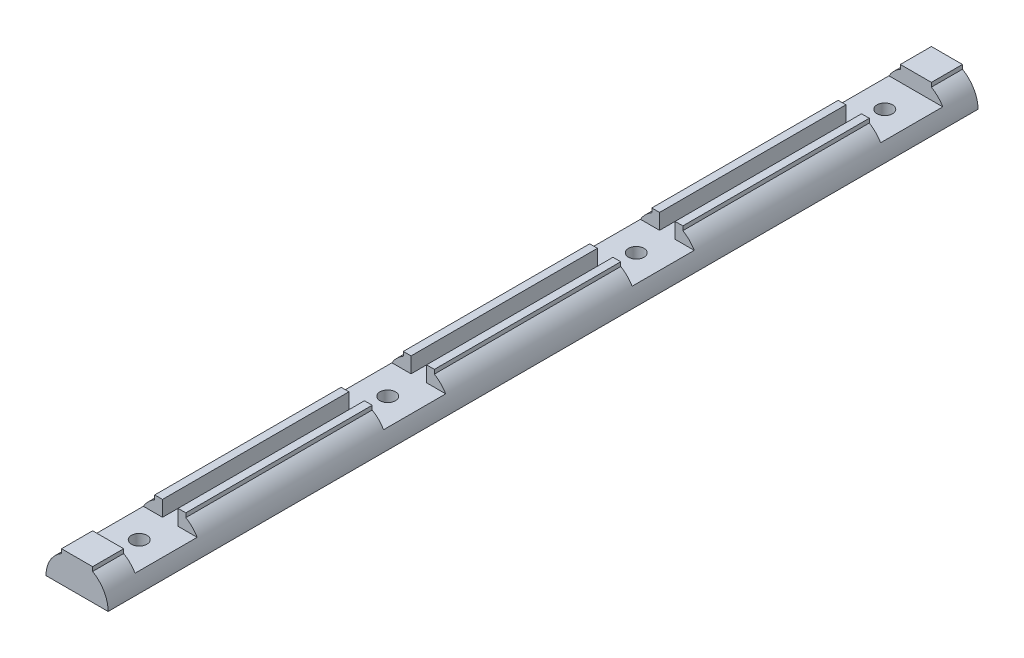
ISO-10303-21;
HEADER;
FILE_DESCRIPTION(('STEP AP214'),'2;1');
FILE_NAME('part.step','',(''),(''),'','','');
FILE_SCHEMA(('AUTOMOTIVE_DESIGN { 1 0 10303 214 1 1 1 1 }'));
ENDSEC;
DATA;
#1=APPLICATION_CONTEXT('core data for automotive mechanical design processes');
#2=APPLICATION_PROTOCOL_DEFINITION('international standard','automotive_design',2000,#1);
#3=PRODUCT_CONTEXT('',#1,'mechanical');
#4=PRODUCT('Part','Part','',(#3));
#5=PRODUCT_RELATED_PRODUCT_CATEGORY('part','',(#4));
#6=PRODUCT_DEFINITION_FORMATION('','',#4);
#7=PRODUCT_DEFINITION_CONTEXT('part definition',#1,'design');
#8=PRODUCT_DEFINITION('design','',#6,#7);
#9=PRODUCT_DEFINITION_SHAPE('','',#8);
#10=(LENGTH_UNIT() NAMED_UNIT(*) SI_UNIT(.MILLI.,.METRE.));
#11=(NAMED_UNIT(*) PLANE_ANGLE_UNIT() SI_UNIT($,.RADIAN.));
#12=(NAMED_UNIT(*) SI_UNIT($,.STERADIAN.) SOLID_ANGLE_UNIT());
#13=UNCERTAINTY_MEASURE_WITH_UNIT(LENGTH_MEASURE(1.E-05),#10,'distance_accuracy_value','');
#14=(GEOMETRIC_REPRESENTATION_CONTEXT(3) GLOBAL_UNCERTAINTY_ASSIGNED_CONTEXT((#13)) GLOBAL_UNIT_ASSIGNED_CONTEXT((#10,
#11,#12)) REPRESENTATION_CONTEXT('',''));
#15=CARTESIAN_POINT('',(0.,0.,0.));
#16=DIRECTION('',(0.,0.,1.));
#17=DIRECTION('',(1.,0.,0.));
#18=AXIS2_PLACEMENT_3D('',#15,#16,#17);
#19=CARTESIAN_POINT('',(0.,0.,140.));
#20=DIRECTION('',(0.,0.,-1.));
#21=DIRECTION('',(-1.,0.,0.));
#22=AXIS2_PLACEMENT_3D('',#19,#20,#21);
#23=CYLINDRICAL_SURFACE('',#22,10.);
#24=CARTESIAN_POINT('',(0.,0.,-140.));
#25=DIRECTION('',(0.,0.,1.));
#26=DIRECTION('',(1.,0.,0.));
#27=AXIS2_PLACEMENT_3D('',#24,#25,#26);
#28=CIRCLE('',#27,10.);
#29=CARTESIAN_POINT('',(-5.,8.66025403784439,-140.));
#30=VERTEX_POINT('',#29);
#31=CARTESIAN_POINT('',(-10.,0.,-140.));
#32=VERTEX_POINT('',#31);
#33=EDGE_CURVE('E324',#30,#32,#28,.T.);
#34=ORIENTED_EDGE('',*,*,#33,.T.);
#35=DIRECTION('',(0.,0.,1.));
#36=VECTOR('',#35,1.);
#37=CARTESIAN_POINT('',(-10.,0.,-140.));
#38=LINE('',#37,#36);
#39=CARTESIAN_POINT('',(-10.,0.,140.));
#40=VERTEX_POINT('',#39);
#41=EDGE_CURVE('E49',#32,#40,#38,.T.);
#42=ORIENTED_EDGE('',*,*,#41,.T.);
#43=CARTESIAN_POINT('',(0.,0.,140.));
#44=DIRECTION('',(0.,0.,1.));
#45=DIRECTION('',(1.,0.,0.));
#46=AXIS2_PLACEMENT_3D('',#43,#44,#45);
#47=CIRCLE('',#46,10.);
#48=CARTESIAN_POINT('',(-5.,8.66025403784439,140.));
#49=VERTEX_POINT('',#48);
#50=EDGE_CURVE('E336',#49,#40,#47,.T.);
#51=ORIENTED_EDGE('',*,*,#50,.F.);
#52=DIRECTION('',(0.,0.,-1.));
#53=VECTOR('',#52,1.);
#54=CARTESIAN_POINT('',(-5.,8.66025403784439,140.));
#55=LINE('',#54,#53);
#56=CARTESIAN_POINT('',(-5.,8.66025403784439,130.));
#57=VERTEX_POINT('',#56);
#58=EDGE_CURVE('E325',#49,#57,#55,.T.);
#59=ORIENTED_EDGE('',*,*,#58,.T.);
#60=CARTESIAN_POINT('',(0.,0.,130.));
#61=DIRECTION('',(0.,0.,1.));
#62=DIRECTION('',(1.,0.,0.));
#63=AXIS2_PLACEMENT_3D('',#60,#61,#62);
#64=CIRCLE('',#63,10.);
#65=CARTESIAN_POINT('',(-8.66025403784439,5.,130.));
#66=VERTEX_POINT('',#65);
#67=EDGE_CURVE('E590',#57,#66,#64,.T.);
#68=ORIENTED_EDGE('',*,*,#67,.T.);
#69=DIRECTION('',(0.,0.,1.));
#70=VECTOR('',#69,1.);
#71=CARTESIAN_POINT('',(-8.66025403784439,5.,110.));
#72=LINE('',#71,#70);
#73=CARTESIAN_POINT('',(-8.66025403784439,5.,110.));
#74=VERTEX_POINT('',#73);
#75=EDGE_CURVE('E626',#74,#66,#72,.T.);
#76=ORIENTED_EDGE('',*,*,#75,.F.);
#77=CARTESIAN_POINT('',(0.,0.,110.));
#78=DIRECTION('',(0.,0.,1.));
#79=DIRECTION('',(1.,0.,0.));
#80=AXIS2_PLACEMENT_3D('',#77,#78,#79);
#81=CIRCLE('',#80,10.);
#82=CARTESIAN_POINT('',(-5.,8.66025403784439,110.));
#83=VERTEX_POINT('',#82);
#84=EDGE_CURVE('E635',#83,#74,#81,.T.);
#85=ORIENTED_EDGE('',*,*,#84,.F.);
#86=CARTESIAN_POINT('',(-5.,8.66025403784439,50.));
#87=VERTEX_POINT('',#86);
#88=EDGE_CURVE('E328',#83,#87,#55,.T.);
#89=ORIENTED_EDGE('',*,*,#88,.T.);
#90=CARTESIAN_POINT('',(0.,0.,50.));
#91=DIRECTION('',(0.,0.,1.));
#92=DIRECTION('',(1.,0.,0.));
#93=AXIS2_PLACEMENT_3D('',#90,#91,#92);
#94=CIRCLE('',#93,10.);
#95=CARTESIAN_POINT('',(-8.66025403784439,5.,50.));
#96=VERTEX_POINT('',#95);
#97=EDGE_CURVE('E501',#87,#96,#94,.T.);
#98=ORIENTED_EDGE('',*,*,#97,.T.);
#99=DIRECTION('',(0.,0.,1.));
#100=VECTOR('',#99,1.);
#101=CARTESIAN_POINT('',(-8.66025403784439,5.,30.));
#102=LINE('',#101,#100);
#103=CARTESIAN_POINT('',(-8.66025403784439,5.,30.));
#104=VERTEX_POINT('',#103);
#105=EDGE_CURVE('E652',#104,#96,#102,.T.);
#106=ORIENTED_EDGE('',*,*,#105,.F.);
#107=CARTESIAN_POINT('',(0.,0.,30.));
#108=DIRECTION('',(0.,0.,1.));
#109=DIRECTION('',(1.,0.,0.));
#110=AXIS2_PLACEMENT_3D('',#107,#108,#109);
#111=CIRCLE('',#110,10.);
#112=CARTESIAN_POINT('',(-5.,8.66025403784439,30.));
#113=VERTEX_POINT('',#112);
#114=EDGE_CURVE('E506',#113,#104,#111,.T.);
#115=ORIENTED_EDGE('',*,*,#114,.F.);
#116=CARTESIAN_POINT('',(-5.,8.66025403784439,-30.));
#117=VERTEX_POINT('',#116);
#118=EDGE_CURVE('E559',#113,#117,#55,.T.);
#119=ORIENTED_EDGE('',*,*,#118,.T.);
#120=CARTESIAN_POINT('',(0.,0.,-30.));
#121=DIRECTION('',(0.,0.,1.));
#122=DIRECTION('',(1.,0.,0.));
#123=AXIS2_PLACEMENT_3D('',#120,#121,#122);
#124=CIRCLE('',#123,10.);
#125=CARTESIAN_POINT('',(-8.66025403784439,5.,-30.));
#126=VERTEX_POINT('',#125);
#127=EDGE_CURVE('E532',#117,#126,#124,.T.);
#128=ORIENTED_EDGE('',*,*,#127,.T.);
#129=DIRECTION('',(0.,0.,1.));
#130=VECTOR('',#129,1.);
#131=CARTESIAN_POINT('',(-8.66025403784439,5.,-50.));
#132=LINE('',#131,#130);
#133=CARTESIAN_POINT('',(-8.66025403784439,5.,-50.));
#134=VERTEX_POINT('',#133);
#135=EDGE_CURVE('E524',#134,#126,#132,.T.);
#136=ORIENTED_EDGE('',*,*,#135,.F.);
#137=CARTESIAN_POINT('',(0.,0.,-50.));
#138=DIRECTION('',(0.,0.,1.));
#139=DIRECTION('',(1.,0.,0.));
#140=AXIS2_PLACEMENT_3D('',#137,#138,#139);
#141=CIRCLE('',#140,10.);
#142=CARTESIAN_POINT('',(-5.,8.66025403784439,-50.));
#143=VERTEX_POINT('',#142);
#144=EDGE_CURVE('E376',#143,#134,#141,.T.);
#145=ORIENTED_EDGE('',*,*,#144,.F.);
#146=CARTESIAN_POINT('',(-5.,8.66025403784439,-110.));
#147=VERTEX_POINT('',#146);
#148=EDGE_CURVE('E467',#143,#147,#55,.T.);
#149=ORIENTED_EDGE('',*,*,#148,.T.);
#150=CARTESIAN_POINT('',(0.,0.,-110.));
#151=DIRECTION('',(0.,0.,1.));
#152=DIRECTION('',(1.,0.,0.));
#153=AXIS2_PLACEMENT_3D('',#150,#151,#152);
#154=CIRCLE('',#153,10.);
#155=CARTESIAN_POINT('',(-8.66025403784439,5.,-110.));
#156=VERTEX_POINT('',#155);
#157=EDGE_CURVE('E428',#147,#156,#154,.T.);
#158=ORIENTED_EDGE('',*,*,#157,.T.);
#159=DIRECTION('',(0.,0.,1.));
#160=VECTOR('',#159,1.);
#161=CARTESIAN_POINT('',(-8.66025403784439,5.,-130.));
#162=LINE('',#161,#160);
#163=CARTESIAN_POINT('',(-8.66025403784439,5.,-130.));
#164=VERTEX_POINT('',#163);
#165=EDGE_CURVE('E411',#164,#156,#162,.T.);
#166=ORIENTED_EDGE('',*,*,#165,.F.);
#167=CARTESIAN_POINT('',(0.,0.,-130.));
#168=DIRECTION('',(0.,0.,1.));
#169=DIRECTION('',(1.,0.,0.));
#170=AXIS2_PLACEMENT_3D('',#167,#168,#169);
#171=CIRCLE('',#170,10.);
#172=CARTESIAN_POINT('',(-5.,8.66025403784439,-130.));
#173=VERTEX_POINT('',#172);
#174=EDGE_CURVE('E436',#173,#164,#171,.T.);
#175=ORIENTED_EDGE('',*,*,#174,.F.);
#176=EDGE_CURVE('E330',#173,#30,#55,.T.);
#177=ORIENTED_EDGE('',*,*,#176,.T.);
#178=EDGE_LOOP('',(#34,#42,#51,#59,#68,#76,#85,#89,#98,#106,#115,#119,#128,#136,#145,#149,#158,
#166,#175,#177));
#179=FACE_BOUND('',#178,.T.);
#180=ADVANCED_FACE('F34',(#179),#23,.T.);
#181=CARTESIAN_POINT('',(10.,0.,140.));
#182=VERTEX_POINT('',#181);
#183=CARTESIAN_POINT('',(5.,8.66025403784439,140.));
#184=VERTEX_POINT('',#183);
#185=EDGE_CURVE('E318',#182,#184,#47,.T.);
#186=ORIENTED_EDGE('',*,*,#185,.F.);
#187=DIRECTION('',(0.,0.,1.));
#188=VECTOR('',#187,1.);
#189=CARTESIAN_POINT('',(10.,0.,-140.));
#190=LINE('',#189,#188);
#191=CARTESIAN_POINT('',(10.,0.,-140.));
#192=VERTEX_POINT('',#191);
#193=EDGE_CURVE('E303',#192,#182,#190,.T.);
#194=ORIENTED_EDGE('',*,*,#193,.F.);
#195=CARTESIAN_POINT('',(5.,8.66025403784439,-140.));
#196=VERTEX_POINT('',#195);
#197=EDGE_CURVE('E315',#192,#196,#28,.T.);
#198=ORIENTED_EDGE('',*,*,#197,.T.);
#199=DIRECTION('',(0.,0.,-1.));
#200=VECTOR('',#199,1.);
#201=CARTESIAN_POINT('',(5.,8.66025403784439,140.));
#202=LINE('',#201,#200);
#203=CARTESIAN_POINT('',(5.,8.66025403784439,-130.));
#204=VERTEX_POINT('',#203);
#205=EDGE_CURVE('E464',#196,#204,#202,.F.);
#206=ORIENTED_EDGE('',*,*,#205,.T.);
#207=CARTESIAN_POINT('',(0.,0.,-130.));
#208=DIRECTION('',(0.,0.,1.));
#209=DIRECTION('',(1.,0.,0.));
#210=AXIS2_PLACEMENT_3D('',#207,#208,#209);
#211=CIRCLE('',#210,10.);
#212=CARTESIAN_POINT('',(8.66025403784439,5.,-130.));
#213=VERTEX_POINT('',#212);
#214=EDGE_CURVE('E431',#213,#204,#211,.T.);
#215=ORIENTED_EDGE('',*,*,#214,.F.);
#216=DIRECTION('',(0.,0.,1.));
#217=VECTOR('',#216,1.);
#218=CARTESIAN_POINT('',(8.66025403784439,5.,-130.));
#219=LINE('',#218,#217);
#220=CARTESIAN_POINT('',(8.66025403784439,5.,-110.));
#221=VERTEX_POINT('',#220);
#222=EDGE_CURVE('E418',#213,#221,#219,.T.);
#223=ORIENTED_EDGE('',*,*,#222,.T.);
#224=CARTESIAN_POINT('',(0.,0.,-110.));
#225=DIRECTION('',(0.,0.,1.));
#226=DIRECTION('',(1.,0.,0.));
#227=AXIS2_PLACEMENT_3D('',#224,#225,#226);
#228=CIRCLE('',#227,10.);
#229=CARTESIAN_POINT('',(5.,8.66025403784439,-110.));
#230=VERTEX_POINT('',#229);
#231=EDGE_CURVE('E421',#221,#230,#228,.T.);
#232=ORIENTED_EDGE('',*,*,#231,.T.);
#233=CARTESIAN_POINT('',(5.,8.66025403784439,-50.));
#234=VERTEX_POINT('',#233);
#235=EDGE_CURVE('E465',#230,#234,#202,.F.);
#236=ORIENTED_EDGE('',*,*,#235,.T.);
#237=CARTESIAN_POINT('',(0.,0.,-50.));
#238=DIRECTION('',(0.,0.,1.));
#239=DIRECTION('',(1.,0.,0.));
#240=AXIS2_PLACEMENT_3D('',#237,#238,#239);
#241=CIRCLE('',#240,10.);
#242=CARTESIAN_POINT('',(8.66025403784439,5.,-50.));
#243=VERTEX_POINT('',#242);
#244=EDGE_CURVE('E540',#243,#234,#241,.T.);
#245=ORIENTED_EDGE('',*,*,#244,.F.);
#246=DIRECTION('',(0.,0.,1.));
#247=VECTOR('',#246,1.);
#248=CARTESIAN_POINT('',(8.66025403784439,5.,-50.));
#249=LINE('',#248,#247);
#250=CARTESIAN_POINT('',(8.66025403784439,5.,-30.));
#251=VERTEX_POINT('',#250);
#252=EDGE_CURVE('E521',#243,#251,#249,.T.);
#253=ORIENTED_EDGE('',*,*,#252,.T.);
#254=CARTESIAN_POINT('',(0.,0.,-30.));
#255=DIRECTION('',(0.,0.,1.));
#256=DIRECTION('',(1.,0.,0.));
#257=AXIS2_PLACEMENT_3D('',#254,#255,#256);
#258=CIRCLE('',#257,10.);
#259=CARTESIAN_POINT('',(5.,8.66025403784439,-30.));
#260=VERTEX_POINT('',#259);
#261=EDGE_CURVE('E485',#251,#260,#258,.T.);
#262=ORIENTED_EDGE('',*,*,#261,.T.);
#263=CARTESIAN_POINT('',(5.,8.66025403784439,30.));
#264=VERTEX_POINT('',#263);
#265=EDGE_CURVE('E469',#260,#264,#202,.F.);
#266=ORIENTED_EDGE('',*,*,#265,.T.);
#267=CARTESIAN_POINT('',(0.,0.,30.));
#268=DIRECTION('',(0.,0.,1.));
#269=DIRECTION('',(1.,0.,0.));
#270=AXIS2_PLACEMENT_3D('',#267,#268,#269);
#271=CIRCLE('',#270,10.);
#272=CARTESIAN_POINT('',(8.66025403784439,5.,30.));
#273=VERTEX_POINT('',#272);
#274=EDGE_CURVE('E483',#273,#264,#271,.T.);
#275=ORIENTED_EDGE('',*,*,#274,.F.);
#276=DIRECTION('',(0.,0.,1.));
#277=VECTOR('',#276,1.);
#278=CARTESIAN_POINT('',(8.66025403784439,5.,30.));
#279=LINE('',#278,#277);
#280=CARTESIAN_POINT('',(8.66025403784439,5.,50.));
#281=VERTEX_POINT('',#280);
#282=EDGE_CURVE('E649',#273,#281,#279,.T.);
#283=ORIENTED_EDGE('',*,*,#282,.T.);
#284=CARTESIAN_POINT('',(0.,0.,50.));
#285=DIRECTION('',(0.,0.,1.));
#286=DIRECTION('',(1.,0.,0.));
#287=AXIS2_PLACEMENT_3D('',#284,#285,#286);
#288=CIRCLE('',#287,10.);
#289=CARTESIAN_POINT('',(5.,8.66025403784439,50.));
#290=VERTEX_POINT('',#289);
#291=EDGE_CURVE('E657',#281,#290,#288,.T.);
#292=ORIENTED_EDGE('',*,*,#291,.T.);
#293=CARTESIAN_POINT('',(5.,8.66025403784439,110.));
#294=VERTEX_POINT('',#293);
#295=EDGE_CURVE('E470',#290,#294,#202,.F.);
#296=ORIENTED_EDGE('',*,*,#295,.T.);
#297=CARTESIAN_POINT('',(0.,0.,110.));
#298=DIRECTION('',(0.,0.,1.));
#299=DIRECTION('',(1.,0.,0.));
#300=AXIS2_PLACEMENT_3D('',#297,#298,#299);
#301=CIRCLE('',#300,10.);
#302=CARTESIAN_POINT('',(8.66025403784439,5.,110.));
#303=VERTEX_POINT('',#302);
#304=EDGE_CURVE('E630',#303,#294,#301,.T.);
#305=ORIENTED_EDGE('',*,*,#304,.F.);
#306=DIRECTION('',(0.,0.,1.));
#307=VECTOR('',#306,1.);
#308=CARTESIAN_POINT('',(8.66025403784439,5.,110.));
#309=LINE('',#308,#307);
#310=CARTESIAN_POINT('',(8.66025403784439,5.,130.));
#311=VERTEX_POINT('',#310);
#312=EDGE_CURVE('E622',#303,#311,#309,.T.);
#313=ORIENTED_EDGE('',*,*,#312,.T.);
#314=CARTESIAN_POINT('',(0.,0.,130.));
#315=DIRECTION('',(0.,0.,1.));
#316=DIRECTION('',(1.,0.,0.));
#317=AXIS2_PLACEMENT_3D('',#314,#315,#316);
#318=CIRCLE('',#317,10.);
#319=CARTESIAN_POINT('',(5.,8.66025403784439,130.));
#320=VERTEX_POINT('',#319);
#321=EDGE_CURVE('E637',#311,#320,#318,.T.);
#322=ORIENTED_EDGE('',*,*,#321,.T.);
#323=EDGE_CURVE('E446',#320,#184,#202,.F.);
#324=ORIENTED_EDGE('',*,*,#323,.T.);
#325=EDGE_LOOP('',(#186,#194,#198,#206,#215,#223,#232,#236,#245,#253,#262,#266,#275,#283,#292,
#296,#305,#313,#322,#324));
#326=FACE_BOUND('',#325,.T.);
#327=ADVANCED_FACE('F313',(#326),#23,.T.);
#328=CARTESIAN_POINT('',(-5.,-10.,-162.360679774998));
#329=DIRECTION('',(-1.,0.,0.));
#330=DIRECTION('',(0.,0.,1.));
#331=AXIS2_PLACEMENT_3D('',#328,#329,#330);
#332=PLANE('',#331);
#333=ORIENTED_EDGE('',*,*,#88,.F.);
#334=DIRECTION('',(0.,1.,0.));
#335=VECTOR('',#334,1.);
#336=CARTESIAN_POINT('',(-5.,-10.,110.));
#337=LINE('',#336,#335);
#338=CARTESIAN_POINT('',(-5.,10.,110.));
#339=VERTEX_POINT('',#338);
#340=EDGE_CURVE('E632',#83,#339,#337,.T.);
#341=ORIENTED_EDGE('',*,*,#340,.T.);
#342=DIRECTION('',(0.,0.,1.));
#343=VECTOR('',#342,1.);
#344=CARTESIAN_POINT('',(-5.,10.,-162.360679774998));
#345=LINE('',#344,#343);
#346=CARTESIAN_POINT('',(-5.,10.,50.));
#347=VERTEX_POINT('',#346);
#348=EDGE_CURVE('E565',#347,#339,#345,.T.);
#349=ORIENTED_EDGE('',*,*,#348,.F.);
#350=DIRECTION('',(0.,1.,0.));
#351=VECTOR('',#350,1.);
#352=CARTESIAN_POINT('',(-5.,-10.,50.));
#353=LINE('',#352,#351);
#354=EDGE_CURVE('E659',#87,#347,#353,.T.);
#355=ORIENTED_EDGE('',*,*,#354,.F.);
#356=EDGE_LOOP('',(#333,#341,#349,#355));
#357=FACE_BOUND('',#356,.T.);
#358=ADVANCED_FACE('F670',(#357),#332,.T.);
#359=CARTESIAN_POINT('',(5.,10.,-162.360679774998));
#360=DIRECTION('',(0.,1.,0.));
#361=DIRECTION('',(0.,0.,1.));
#362=AXIS2_PLACEMENT_3D('',#359,#360,#361);
#363=PLANE('',#362);
#364=ORIENTED_EDGE('',*,*,#348,.T.);
#365=DIRECTION('',(-1.,0.,0.));
#366=VECTOR('',#365,1.);
#367=CARTESIAN_POINT('',(8.66025403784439,10.,110.));
#368=LINE('',#367,#366);
#369=CARTESIAN_POINT('',(-2.5,10.,110.));
#370=VERTEX_POINT('',#369);
#371=EDGE_CURVE('E615',#370,#339,#368,.T.);
#372=ORIENTED_EDGE('',*,*,#371,.F.);
#373=DIRECTION('',(0.,0.,1.));
#374=VECTOR('',#373,1.);
#375=CARTESIAN_POINT('',(-2.5,10.,110.));
#376=LINE('',#375,#374);
#377=CARTESIAN_POINT('',(-2.5,10.,50.));
#378=VERTEX_POINT('',#377);
#379=EDGE_CURVE('E371',#378,#370,#376,.T.);
#380=ORIENTED_EDGE('',*,*,#379,.F.);
#381=DIRECTION('',(-1.,0.,0.));
#382=VECTOR('',#381,1.);
#383=CARTESIAN_POINT('',(8.66025403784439,10.,50.));
#384=LINE('',#383,#382);
#385=EDGE_CURVE('E646',#378,#347,#384,.T.);
#386=ORIENTED_EDGE('',*,*,#385,.T.);
#387=EDGE_LOOP('',(#364,#372,#380,#386));
#388=FACE_BOUND('',#387,.T.);
#389=ADVANCED_FACE('F754',(#388),#363,.T.);
#390=DIRECTION('',(0.,0.,-1.));
#391=VECTOR('',#390,1.);
#392=CARTESIAN_POINT('',(2.5,10.,110.));
#393=LINE('',#392,#391);
#394=CARTESIAN_POINT('',(2.5,10.,110.));
#395=VERTEX_POINT('',#394);
#396=CARTESIAN_POINT('',(2.5,10.,50.));
#397=VERTEX_POINT('',#396);
#398=EDGE_CURVE('E379',#395,#397,#393,.T.);
#399=ORIENTED_EDGE('',*,*,#398,.F.);
#400=CARTESIAN_POINT('',(5.,10.,110.));
#401=VERTEX_POINT('',#400);
#402=EDGE_CURVE('E618',#401,#395,#368,.T.);
#403=ORIENTED_EDGE('',*,*,#402,.F.);
#404=DIRECTION('',(0.,0.,1.));
#405=VECTOR('',#404,1.);
#406=CARTESIAN_POINT('',(5.,10.,-162.360679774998));
#407=LINE('',#406,#405);
#408=CARTESIAN_POINT('',(5.,10.,50.));
#409=VERTEX_POINT('',#408);
#410=EDGE_CURVE('E682',#409,#401,#407,.T.);
#411=ORIENTED_EDGE('',*,*,#410,.F.);
#412=EDGE_CURVE('E648',#409,#397,#384,.T.);
#413=ORIENTED_EDGE('',*,*,#412,.T.);
#414=EDGE_LOOP('',(#399,#403,#411,#413));
#415=FACE_BOUND('',#414,.T.);
#416=ADVANCED_FACE('F730',(#415),#363,.T.);
#417=CARTESIAN_POINT('',(5.,-10.,-162.360679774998));
#418=DIRECTION('',(1.,0.,0.));
#419=DIRECTION('',(0.,0.,-1.));
#420=AXIS2_PLACEMENT_3D('',#417,#418,#419);
#421=PLANE('',#420);
#422=ORIENTED_EDGE('',*,*,#410,.T.);
#423=DIRECTION('',(0.,-1.,0.));
#424=VECTOR('',#423,1.);
#425=CARTESIAN_POINT('',(5.,-10.,110.));
#426=LINE('',#425,#424);
#427=EDGE_CURVE('E625',#401,#294,#426,.T.);
#428=ORIENTED_EDGE('',*,*,#427,.T.);
#429=ORIENTED_EDGE('',*,*,#295,.F.);
#430=DIRECTION('',(0.,-1.,0.));
#431=VECTOR('',#430,1.);
#432=CARTESIAN_POINT('',(5.,-10.,50.));
#433=LINE('',#432,#431);
#434=EDGE_CURVE('E655',#409,#290,#433,.T.);
#435=ORIENTED_EDGE('',*,*,#434,.F.);
#436=EDGE_LOOP('',(#422,#428,#429,#435));
#437=FACE_BOUND('',#436,.T.);
#438=ADVANCED_FACE('F732',(#437),#421,.T.);
#439=ORIENTED_EDGE('',*,*,#118,.F.);
#440=DIRECTION('',(0.,1.,0.));
#441=VECTOR('',#440,1.);
#442=CARTESIAN_POINT('',(-5.,-10.,30.));
#443=LINE('',#442,#441);
#444=CARTESIAN_POINT('',(-5.,10.,30.));
#445=VERTEX_POINT('',#444);
#446=EDGE_CURVE('E499',#113,#445,#443,.T.);
#447=ORIENTED_EDGE('',*,*,#446,.T.);
#448=CARTESIAN_POINT('',(-5.,10.,-30.));
#449=VERTEX_POINT('',#448);
#450=EDGE_CURVE('E366',#449,#445,#345,.T.);
#451=ORIENTED_EDGE('',*,*,#450,.F.);
#452=DIRECTION('',(0.,1.,0.));
#453=VECTOR('',#452,1.);
#454=CARTESIAN_POINT('',(-5.,-10.,-30.));
#455=LINE('',#454,#453);
#456=EDGE_CURVE('E530',#117,#449,#455,.T.);
#457=ORIENTED_EDGE('',*,*,#456,.F.);
#458=EDGE_LOOP('',(#439,#447,#451,#457));
#459=FACE_BOUND('',#458,.T.);
#460=ADVANCED_FACE('F564',(#459),#332,.T.);
#461=ORIENTED_EDGE('',*,*,#450,.T.);
#462=DIRECTION('',(-1.,0.,0.));
#463=VECTOR('',#462,1.);
#464=CARTESIAN_POINT('',(8.66025403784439,10.,30.));
#465=LINE('',#464,#463);
#466=CARTESIAN_POINT('',(-2.5,10.,30.));
#467=VERTEX_POINT('',#466);
#468=EDGE_CURVE('E351',#467,#445,#465,.T.);
#469=ORIENTED_EDGE('',*,*,#468,.F.);
#470=CARTESIAN_POINT('',(-2.5,10.,-30.));
#471=VERTEX_POINT('',#470);
#472=EDGE_CURVE('E364',#471,#467,#376,.T.);
#473=ORIENTED_EDGE('',*,*,#472,.F.);
#474=DIRECTION('',(-1.,0.,0.));
#475=VECTOR('',#474,1.);
#476=CARTESIAN_POINT('',(8.66025403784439,10.,-30.));
#477=LINE('',#476,#475);
#478=EDGE_CURVE('E518',#471,#449,#477,.T.);
#479=ORIENTED_EDGE('',*,*,#478,.T.);
#480=EDGE_LOOP('',(#461,#469,#473,#479));
#481=FACE_BOUND('',#480,.T.);
#482=ADVANCED_FACE('F362',(#481),#363,.T.);
#483=CARTESIAN_POINT('',(2.5,10.,30.));
#484=VERTEX_POINT('',#483);
#485=CARTESIAN_POINT('',(2.5,10.,-30.));
#486=VERTEX_POINT('',#485);
#487=EDGE_CURVE('E720',#484,#486,#393,.T.);
#488=ORIENTED_EDGE('',*,*,#487,.F.);
#489=CARTESIAN_POINT('',(5.,10.,30.));
#490=VERTEX_POINT('',#489);
#491=EDGE_CURVE('E367',#490,#484,#465,.T.);
#492=ORIENTED_EDGE('',*,*,#491,.F.);
#493=CARTESIAN_POINT('',(5.,10.,-30.));
#494=VERTEX_POINT('',#493);
#495=EDGE_CURVE('E494',#494,#490,#407,.T.);
#496=ORIENTED_EDGE('',*,*,#495,.F.);
#497=EDGE_CURVE('E520',#494,#486,#477,.T.);
#498=ORIENTED_EDGE('',*,*,#497,.T.);
#499=EDGE_LOOP('',(#488,#492,#496,#498));
#500=FACE_BOUND('',#499,.T.);
#501=ADVANCED_FACE('F793',(#500),#363,.T.);
#502=ORIENTED_EDGE('',*,*,#495,.T.);
#503=DIRECTION('',(0.,-1.,0.));
#504=VECTOR('',#503,1.);
#505=CARTESIAN_POINT('',(5.,-10.,30.));
#506=LINE('',#505,#504);
#507=EDGE_CURVE('E493',#490,#264,#506,.T.);
#508=ORIENTED_EDGE('',*,*,#507,.T.);
#509=ORIENTED_EDGE('',*,*,#265,.F.);
#510=DIRECTION('',(0.,-1.,0.));
#511=VECTOR('',#510,1.);
#512=CARTESIAN_POINT('',(5.,-10.,-30.));
#513=LINE('',#512,#511);
#514=EDGE_CURVE('E491',#494,#260,#513,.T.);
#515=ORIENTED_EDGE('',*,*,#514,.F.);
#516=EDGE_LOOP('',(#502,#508,#509,#515));
#517=FACE_BOUND('',#516,.T.);
#518=ADVANCED_FACE('F490',(#517),#421,.T.);
#519=CARTESIAN_POINT('',(2.5,-215.056810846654,110.));
#520=DIRECTION('',(1.,0.,0.));
#521=DIRECTION('',(0.,0.,-1.));
#522=AXIS2_PLACEMENT_3D('',#519,#520,#521);
#523=PLANE('',#522);
#524=DIRECTION('',(0.,-1.,0.));
#525=VECTOR('',#524,1.);
#526=CARTESIAN_POINT('',(2.5,-215.056810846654,30.));
#527=LINE('',#526,#525);
#528=CARTESIAN_POINT('',(2.5,5.,30.));
#529=VERTEX_POINT('',#528);
#530=EDGE_CURVE('E497',#484,#529,#527,.T.);
#531=ORIENTED_EDGE('',*,*,#530,.F.);
#532=ORIENTED_EDGE('',*,*,#487,.T.);
#533=DIRECTION('',(0.,-1.,0.));
#534=VECTOR('',#533,1.);
#535=CARTESIAN_POINT('',(2.5,-215.056810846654,-30.));
#536=LINE('',#535,#534);
#537=CARTESIAN_POINT('',(2.5,5.,-30.));
#538=VERTEX_POINT('',#537);
#539=EDGE_CURVE('E523',#486,#538,#536,.T.);
#540=ORIENTED_EDGE('',*,*,#539,.T.);
#541=DIRECTION('',(0.,0.,-1.));
#542=VECTOR('',#541,1.);
#543=CARTESIAN_POINT('',(2.5,5.,110.));
#544=LINE('',#543,#542);
#545=EDGE_CURVE('E391',#529,#538,#544,.T.);
#546=ORIENTED_EDGE('',*,*,#545,.F.);
#547=EDGE_LOOP('',(#531,#532,#540,#546));
#548=FACE_BOUND('',#547,.T.);
#549=ADVANCED_FACE('F718',(#548),#523,.F.);
#550=CARTESIAN_POINT('',(-2.5,-215.056810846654,110.));
#551=DIRECTION('',(-1.,0.,0.));
#552=DIRECTION('',(0.,0.,1.));
#553=AXIS2_PLACEMENT_3D('',#550,#551,#552);
#554=PLANE('',#553);
#555=DIRECTION('',(0.,1.,0.));
#556=VECTOR('',#555,1.);
#557=CARTESIAN_POINT('',(-2.5,-215.056810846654,30.));
#558=LINE('',#557,#556);
#559=CARTESIAN_POINT('',(-2.5,5.,30.));
#560=VERTEX_POINT('',#559);
#561=EDGE_CURVE('E42',#560,#467,#558,.T.);
#562=ORIENTED_EDGE('',*,*,#561,.F.);
#563=DIRECTION('',(0.,0.,1.));
#564=VECTOR('',#563,1.);
#565=CARTESIAN_POINT('',(-2.5,5.,110.));
#566=LINE('',#565,#564);
#567=CARTESIAN_POINT('',(-2.5,5.,-30.));
#568=VERTEX_POINT('',#567);
#569=EDGE_CURVE('E385',#568,#560,#566,.T.);
#570=ORIENTED_EDGE('',*,*,#569,.F.);
#571=DIRECTION('',(0.,1.,0.));
#572=VECTOR('',#571,1.);
#573=CARTESIAN_POINT('',(-2.5,-215.056810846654,-30.));
#574=LINE('',#573,#572);
#575=EDGE_CURVE('E339',#568,#471,#574,.T.);
#576=ORIENTED_EDGE('',*,*,#575,.T.);
#577=ORIENTED_EDGE('',*,*,#472,.T.);
#578=EDGE_LOOP('',(#562,#570,#576,#577));
#579=FACE_BOUND('',#578,.T.);
#580=ADVANCED_FACE('F369',(#579),#554,.F.);
#581=ORIENTED_EDGE('',*,*,#148,.F.);
#582=DIRECTION('',(0.,1.,0.));
#583=VECTOR('',#582,1.);
#584=CARTESIAN_POINT('',(-5.,-10.,-50.));
#585=LINE('',#584,#583);
#586=CARTESIAN_POINT('',(-5.,10.,-50.));
#587=VERTEX_POINT('',#586);
#588=EDGE_CURVE('E542',#143,#587,#585,.T.);
#589=ORIENTED_EDGE('',*,*,#588,.T.);
#590=CARTESIAN_POINT('',(-5.,10.,-110.));
#591=VERTEX_POINT('',#590);
#592=EDGE_CURVE('E458',#591,#587,#345,.T.);
#593=ORIENTED_EDGE('',*,*,#592,.F.);
#594=DIRECTION('',(0.,1.,0.));
#595=VECTOR('',#594,1.);
#596=CARTESIAN_POINT('',(-5.,-10.,-110.));
#597=LINE('',#596,#595);
#598=EDGE_CURVE('E425',#147,#591,#597,.T.);
#599=ORIENTED_EDGE('',*,*,#598,.F.);
#600=EDGE_LOOP('',(#581,#589,#593,#599));
#601=FACE_BOUND('',#600,.T.);
#602=ADVANCED_FACE('F763',(#601),#332,.T.);
#603=ORIENTED_EDGE('',*,*,#592,.T.);
#604=DIRECTION('',(-1.,0.,0.));
#605=VECTOR('',#604,1.);
#606=CARTESIAN_POINT('',(8.66025403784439,10.,-50.));
#607=LINE('',#606,#605);
#608=CARTESIAN_POINT('',(-2.5,10.,-50.));
#609=VERTEX_POINT('',#608);
#610=EDGE_CURVE('E511',#609,#587,#607,.T.);
#611=ORIENTED_EDGE('',*,*,#610,.F.);
#612=CARTESIAN_POINT('',(-2.5,10.,-110.));
#613=VERTEX_POINT('',#612);
#614=EDGE_CURVE('E370',#613,#609,#376,.T.);
#615=ORIENTED_EDGE('',*,*,#614,.F.);
#616=DIRECTION('',(-1.,0.,0.));
#617=VECTOR('',#616,1.);
#618=CARTESIAN_POINT('',(8.66025403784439,10.,-110.));
#619=LINE('',#618,#617);
#620=EDGE_CURVE('E415',#613,#591,#619,.T.);
#621=ORIENTED_EDGE('',*,*,#620,.T.);
#622=EDGE_LOOP('',(#603,#611,#615,#621));
#623=FACE_BOUND('',#622,.T.);
#624=ADVANCED_FACE('F786',(#623),#363,.T.);
#625=CARTESIAN_POINT('',(2.5,10.,-50.));
#626=VERTEX_POINT('',#625);
#627=CARTESIAN_POINT('',(2.5,10.,-110.));
#628=VERTEX_POINT('',#627);
#629=EDGE_CURVE('E374',#626,#628,#393,.T.);
#630=ORIENTED_EDGE('',*,*,#629,.F.);
#631=CARTESIAN_POINT('',(5.,10.,-50.));
#632=VERTEX_POINT('',#631);
#633=EDGE_CURVE('E514',#632,#626,#607,.T.);
#634=ORIENTED_EDGE('',*,*,#633,.F.);
#635=CARTESIAN_POINT('',(5.,10.,-110.));
#636=VERTEX_POINT('',#635);
#637=EDGE_CURVE('E463',#636,#632,#407,.T.);
#638=ORIENTED_EDGE('',*,*,#637,.F.);
#639=EDGE_CURVE('E409',#636,#628,#619,.T.);
#640=ORIENTED_EDGE('',*,*,#639,.T.);
#641=EDGE_LOOP('',(#630,#634,#638,#640));
#642=FACE_BOUND('',#641,.T.);
#643=ADVANCED_FACE('F696',(#642),#363,.T.);
#644=ORIENTED_EDGE('',*,*,#637,.T.);
#645=DIRECTION('',(0.,-1.,0.));
#646=VECTOR('',#645,1.);
#647=CARTESIAN_POINT('',(5.,-10.,-50.));
#648=LINE('',#647,#646);
#649=EDGE_CURVE('E537',#632,#234,#648,.T.);
#650=ORIENTED_EDGE('',*,*,#649,.T.);
#651=ORIENTED_EDGE('',*,*,#235,.F.);
#652=DIRECTION('',(0.,-1.,0.));
#653=VECTOR('',#652,1.);
#654=CARTESIAN_POINT('',(5.,-10.,-110.));
#655=LINE('',#654,#653);
#656=EDGE_CURVE('E333',#636,#230,#655,.T.);
#657=ORIENTED_EDGE('',*,*,#656,.F.);
#658=EDGE_LOOP('',(#644,#650,#651,#657));
#659=FACE_BOUND('',#658,.T.);
#660=ADVANCED_FACE('F691',(#659),#421,.T.);
#661=DIRECTION('',(0.,-1.,0.));
#662=VECTOR('',#661,1.);
#663=CARTESIAN_POINT('',(2.5,-215.056810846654,-50.));
#664=LINE('',#663,#662);
#665=CARTESIAN_POINT('',(2.5,5.,-50.));
#666=VERTEX_POINT('',#665);
#667=EDGE_CURVE('E535',#626,#666,#664,.T.);
#668=ORIENTED_EDGE('',*,*,#667,.F.);
#669=ORIENTED_EDGE('',*,*,#629,.T.);
#670=DIRECTION('',(0.,1.,0.));
#671=VECTOR('',#670,1.);
#672=CARTESIAN_POINT('',(2.5,-215.056810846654,-110.));
#673=LINE('',#672,#671);
#674=CARTESIAN_POINT('',(2.5,5.,-110.));
#675=VERTEX_POINT('',#674);
#676=EDGE_CURVE('E390',#675,#628,#673,.T.);
#677=ORIENTED_EDGE('',*,*,#676,.F.);
#678=EDGE_CURVE('E392',#666,#675,#544,.T.);
#679=ORIENTED_EDGE('',*,*,#678,.F.);
#680=EDGE_LOOP('',(#668,#669,#677,#679));
#681=FACE_BOUND('',#680,.T.);
#682=ADVANCED_FACE('F703',(#681),#523,.F.);
#683=DIRECTION('',(0.,1.,0.));
#684=VECTOR('',#683,1.);
#685=CARTESIAN_POINT('',(-2.5,-215.056810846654,-50.));
#686=LINE('',#685,#684);
#687=CARTESIAN_POINT('',(-2.5,5.,-50.));
#688=VERTEX_POINT('',#687);
#689=EDGE_CURVE('E342',#688,#609,#686,.T.);
#690=ORIENTED_EDGE('',*,*,#689,.F.);
#691=CARTESIAN_POINT('',(-2.5,5.,-110.));
#692=VERTEX_POINT('',#691);
#693=EDGE_CURVE('E381',#692,#688,#566,.T.);
#694=ORIENTED_EDGE('',*,*,#693,.F.);
#695=DIRECTION('',(0.,1.,0.));
#696=VECTOR('',#695,1.);
#697=CARTESIAN_POINT('',(-2.5,-215.056810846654,-110.));
#698=LINE('',#697,#696);
#699=EDGE_CURVE('E393',#692,#613,#698,.T.);
#700=ORIENTED_EDGE('',*,*,#699,.T.);
#701=ORIENTED_EDGE('',*,*,#614,.T.);
#702=EDGE_LOOP('',(#690,#694,#700,#701));
#703=FACE_BOUND('',#702,.T.);
#704=ADVANCED_FACE('F780',(#703),#554,.F.);
#705=CARTESIAN_POINT('',(0.,0.,-110.));
#706=DIRECTION('',(0.,0.,1.));
#707=DIRECTION('',(1.,0.,0.));
#708=AXIS2_PLACEMENT_3D('',#705,#706,#707);
#709=PLANE('',#708);
#710=DIRECTION('',(1.,0.,0.));
#711=VECTOR('',#710,1.);
#712=CARTESIAN_POINT('',(8.66025403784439,5.,-110.));
#713=LINE('',#712,#711);
#714=EDGE_CURVE('E404',#675,#221,#713,.T.);
#715=ORIENTED_EDGE('',*,*,#714,.F.);
#716=ORIENTED_EDGE('',*,*,#676,.T.);
#717=ORIENTED_EDGE('',*,*,#639,.F.);
#718=ORIENTED_EDGE('',*,*,#656,.T.);
#719=ORIENTED_EDGE('',*,*,#231,.F.);
#720=EDGE_LOOP('',(#715,#716,#717,#718,#719));
#721=FACE_BOUND('',#720,.T.);
#722=ADVANCED_FACE('F772',(#721),#709,.F.);
#723=ORIENTED_EDGE('',*,*,#176,.F.);
#724=DIRECTION('',(0.,1.,0.));
#725=VECTOR('',#724,1.);
#726=CARTESIAN_POINT('',(-5.,-10.,-130.));
#727=LINE('',#726,#725);
#728=CARTESIAN_POINT('',(-5.,10.,-130.));
#729=VERTEX_POINT('',#728);
#730=EDGE_CURVE('E433',#173,#729,#727,.T.);
#731=ORIENTED_EDGE('',*,*,#730,.T.);
#732=CARTESIAN_POINT('',(-5.,10.,-140.));
#733=VERTEX_POINT('',#732);
#734=EDGE_CURVE('E441',#733,#729,#345,.T.);
#735=ORIENTED_EDGE('',*,*,#734,.F.);
#736=DIRECTION('',(0.,1.,0.));
#737=VECTOR('',#736,1.);
#738=CARTESIAN_POINT('',(-5.,-10.,-140.));
#739=LINE('',#738,#737);
#740=EDGE_CURVE('E443',#30,#733,#739,.T.);
#741=ORIENTED_EDGE('',*,*,#740,.F.);
#742=EDGE_LOOP('',(#723,#731,#735,#741));
#743=FACE_BOUND('',#742,.T.);
#744=ADVANCED_FACE('F765',(#743),#332,.T.);
#745=ORIENTED_EDGE('',*,*,#734,.T.);
#746=DIRECTION('',(-1.,0.,0.));
#747=VECTOR('',#746,1.);
#748=CARTESIAN_POINT('',(8.66025403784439,10.,-130.));
#749=LINE('',#748,#747);
#750=CARTESIAN_POINT('',(5.,10.,-130.));
#751=VERTEX_POINT('',#750);
#752=EDGE_CURVE('E408',#751,#729,#749,.T.);
#753=ORIENTED_EDGE('',*,*,#752,.F.);
#754=CARTESIAN_POINT('',(5.,10.,-140.));
#755=VERTEX_POINT('',#754);
#756=EDGE_CURVE('E460',#755,#751,#407,.T.);
#757=ORIENTED_EDGE('',*,*,#756,.F.);
#758=DIRECTION('',(1.,0.,0.));
#759=VECTOR('',#758,1.);
#760=CARTESIAN_POINT('',(5.,10.,-140.));
#761=LINE('',#760,#759);
#762=EDGE_CURVE('E440',#733,#755,#761,.T.);
#763=ORIENTED_EDGE('',*,*,#762,.F.);
#764=EDGE_LOOP('',(#745,#753,#757,#763));
#765=FACE_BOUND('',#764,.T.);
#766=ADVANCED_FACE('F770',(#765),#363,.T.);
#767=ORIENTED_EDGE('',*,*,#756,.T.);
#768=DIRECTION('',(0.,-1.,0.));
#769=VECTOR('',#768,1.);
#770=CARTESIAN_POINT('',(5.,-10.,-130.));
#771=LINE('',#770,#769);
#772=EDGE_CURVE('E335',#751,#204,#771,.T.);
#773=ORIENTED_EDGE('',*,*,#772,.T.);
#774=ORIENTED_EDGE('',*,*,#205,.F.);
#775=DIRECTION('',(0.,-1.,0.));
#776=VECTOR('',#775,1.);
#777=CARTESIAN_POINT('',(5.,-10.,-140.));
#778=LINE('',#777,#776);
#779=EDGE_CURVE('E323',#755,#196,#778,.T.);
#780=ORIENTED_EDGE('',*,*,#779,.F.);
#781=EDGE_LOOP('',(#767,#773,#774,#780));
#782=FACE_BOUND('',#781,.T.);
#783=ADVANCED_FACE('F778',(#782),#421,.T.);
#784=CARTESIAN_POINT('',(0.,0.,140.));
#785=DIRECTION('',(0.,0.,1.));
#786=DIRECTION('',(1.,0.,0.));
#787=AXIS2_PLACEMENT_3D('',#784,#785,#786);
#788=PLANE('',#787);
#789=DIRECTION('',(-1.,0.,0.));
#790=VECTOR('',#789,1.);
#791=CARTESIAN_POINT('',(10.,0.,140.));
#792=LINE('',#791,#790);
#793=EDGE_CURVE('E309',#182,#40,#792,.T.);
#794=ORIENTED_EDGE('',*,*,#793,.F.);
#795=ORIENTED_EDGE('',*,*,#185,.T.);
#796=DIRECTION('',(0.,1.,0.));
#797=VECTOR('',#796,1.);
#798=CARTESIAN_POINT('',(5.,-10.,140.));
#799=LINE('',#798,#797);
#800=CARTESIAN_POINT('',(5.,10.,140.));
#801=VERTEX_POINT('',#800);
#802=EDGE_CURVE('E449',#184,#801,#799,.T.);
#803=ORIENTED_EDGE('',*,*,#802,.T.);
#804=DIRECTION('',(-1.,0.,0.));
#805=VECTOR('',#804,1.);
#806=CARTESIAN_POINT('',(5.,10.,140.));
#807=LINE('',#806,#805);
#808=CARTESIAN_POINT('',(-5.,10.,140.));
#809=VERTEX_POINT('',#808);
#810=EDGE_CURVE('E452',#801,#809,#807,.T.);
#811=ORIENTED_EDGE('',*,*,#810,.T.);
#812=DIRECTION('',(0.,-1.,0.));
#813=VECTOR('',#812,1.);
#814=CARTESIAN_POINT('',(-5.,-10.,140.));
#815=LINE('',#814,#813);
#816=EDGE_CURVE('E438',#809,#49,#815,.T.);
#817=ORIENTED_EDGE('',*,*,#816,.T.);
#818=ORIENTED_EDGE('',*,*,#50,.T.);
#819=EDGE_LOOP('',(#794,#795,#803,#811,#817,#818));
#820=FACE_BOUND('',#819,.T.);
#821=ADVANCED_FACE('F583',(#820),#788,.T.);
#822=CARTESIAN_POINT('',(0.,0.,-140.));
#823=DIRECTION('',(0.,0.,1.));
#824=DIRECTION('',(1.,0.,0.));
#825=AXIS2_PLACEMENT_3D('',#822,#823,#824);
#826=PLANE('',#825);
#827=ORIENTED_EDGE('',*,*,#197,.F.);
#828=DIRECTION('',(-1.,0.,0.));
#829=VECTOR('',#828,1.);
#830=CARTESIAN_POINT('',(10.,0.,-140.));
#831=LINE('',#830,#829);
#832=EDGE_CURVE('E299',#192,#32,#831,.T.);
#833=ORIENTED_EDGE('',*,*,#832,.T.);
#834=ORIENTED_EDGE('',*,*,#33,.F.);
#835=ORIENTED_EDGE('',*,*,#740,.T.);
#836=ORIENTED_EDGE('',*,*,#762,.T.);
#837=ORIENTED_EDGE('',*,*,#779,.T.);
#838=EDGE_LOOP('',(#827,#833,#834,#835,#836,#837));
#839=FACE_BOUND('',#838,.T.);
#840=ADVANCED_FACE('F321',(#839),#826,.F.);
#841=DIRECTION('',(0.,1.,0.));
#842=VECTOR('',#841,1.);
#843=CARTESIAN_POINT('',(-5.,-10.,130.));
#844=LINE('',#843,#842);
#845=CARTESIAN_POINT('',(-5.,10.,130.));
#846=VERTEX_POINT('',#845);
#847=EDGE_CURVE('E587',#57,#846,#844,.T.);
#848=ORIENTED_EDGE('',*,*,#847,.F.);
#849=ORIENTED_EDGE('',*,*,#58,.F.);
#850=ORIENTED_EDGE('',*,*,#816,.F.);
#851=EDGE_CURVE('E459',#846,#809,#345,.T.);
#852=ORIENTED_EDGE('',*,*,#851,.F.);
#853=EDGE_LOOP('',(#848,#849,#850,#852));
#854=FACE_BOUND('',#853,.T.);
#855=ADVANCED_FACE('F586',(#854),#332,.T.);
#856=DIRECTION('',(-1.,0.,0.));
#857=VECTOR('',#856,1.);
#858=CARTESIAN_POINT('',(8.66025403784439,10.,130.));
#859=LINE('',#858,#857);
#860=CARTESIAN_POINT('',(5.,10.,130.));
#861=VERTEX_POINT('',#860);
#862=EDGE_CURVE('E578',#861,#846,#859,.T.);
#863=ORIENTED_EDGE('',*,*,#862,.T.);
#864=ORIENTED_EDGE('',*,*,#851,.T.);
#865=ORIENTED_EDGE('',*,*,#810,.F.);
#866=EDGE_CURVE('E455',#861,#801,#407,.T.);
#867=ORIENTED_EDGE('',*,*,#866,.F.);
#868=EDGE_LOOP('',(#863,#864,#865,#867));
#869=FACE_BOUND('',#868,.T.);
#870=ADVANCED_FACE('F576',(#869),#363,.T.);
#871=DIRECTION('',(0.,-1.,0.));
#872=VECTOR('',#871,1.);
#873=CARTESIAN_POINT('',(5.,-10.,130.));
#874=LINE('',#873,#872);
#875=EDGE_CURVE('E12',#861,#320,#874,.T.);
#876=ORIENTED_EDGE('',*,*,#875,.F.);
#877=ORIENTED_EDGE('',*,*,#866,.T.);
#878=ORIENTED_EDGE('',*,*,#802,.F.);
#879=ORIENTED_EDGE('',*,*,#323,.F.);
#880=EDGE_LOOP('',(#876,#877,#878,#879));
#881=FACE_BOUND('',#880,.T.);
#882=ADVANCED_FACE('F681',(#881),#421,.T.);
#883=CARTESIAN_POINT('',(0.,0.,-130.));
#884=DIRECTION('',(0.,0.,1.));
#885=DIRECTION('',(1.,0.,0.));
#886=AXIS2_PLACEMENT_3D('',#883,#884,#885);
#887=PLANE('',#886);
#888=ORIENTED_EDGE('',*,*,#174,.T.);
#889=DIRECTION('',(1.,0.,0.));
#890=VECTOR('',#889,1.);
#891=CARTESIAN_POINT('',(8.66025403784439,5.,-130.));
#892=LINE('',#891,#890);
#893=EDGE_CURVE('E405',#164,#213,#892,.T.);
#894=ORIENTED_EDGE('',*,*,#893,.T.);
#895=ORIENTED_EDGE('',*,*,#214,.T.);
#896=ORIENTED_EDGE('',*,*,#772,.F.);
#897=ORIENTED_EDGE('',*,*,#752,.T.);
#898=ORIENTED_EDGE('',*,*,#730,.F.);
#899=EDGE_LOOP('',(#888,#894,#895,#896,#897,#898));
#900=FACE_BOUND('',#899,.T.);
#901=ADVANCED_FACE('F812',(#900),#887,.T.);
#902=ORIENTED_EDGE('',*,*,#620,.F.);
#903=ORIENTED_EDGE('',*,*,#699,.F.);
#904=EDGE_CURVE('E412',#156,#692,#713,.T.);
#905=ORIENTED_EDGE('',*,*,#904,.F.);
#906=ORIENTED_EDGE('',*,*,#157,.F.);
#907=ORIENTED_EDGE('',*,*,#598,.T.);
#908=EDGE_LOOP('',(#902,#903,#905,#906,#907));
#909=FACE_BOUND('',#908,.T.);
#910=ADVANCED_FACE('F783',(#909),#709,.F.);
#911=CARTESIAN_POINT('',(8.66025403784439,5.,-130.));
#912=DIRECTION('',(0.,-1.,0.));
#913=DIRECTION('',(0.,0.,-1.));
#914=AXIS2_PLACEMENT_3D('',#911,#912,#913);
#915=PLANE('',#914);
#916=CARTESIAN_POINT('',(0.,4.99999999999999,120.));
#917=DIRECTION('',(0.,1.,0.));
#918=DIRECTION('',(0.,0.,1.));
#919=AXIS2_PLACEMENT_3D('',#916,#917,#918);
#920=CIRCLE('',#919,2.5);
#921=CARTESIAN_POINT('',(0.,4.99999999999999,122.5));
#922=VERTEX_POINT('',#921);
#923=EDGE_CURVE('E603',#922,#922,#920,.T.);
#924=ORIENTED_EDGE('',*,*,#923,.F.);
#925=EDGE_LOOP('',(#924));
#926=FACE_BOUND('',#925,.T.);
#927=CARTESIAN_POINT('',(0.,4.99999999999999,40.));
#928=DIRECTION('',(0.,1.,0.));
#929=DIRECTION('',(0.,0.,1.));
#930=AXIS2_PLACEMENT_3D('',#927,#928,#929);
#931=CIRCLE('',#930,2.5);
#932=CARTESIAN_POINT('',(0.,4.99999999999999,42.5));
#933=VERTEX_POINT('',#932);
#934=EDGE_CURVE('E606',#933,#933,#931,.T.);
#935=ORIENTED_EDGE('',*,*,#934,.F.);
#936=EDGE_LOOP('',(#935));
#937=FACE_BOUND('',#936,.T.);
#938=CARTESIAN_POINT('',(0.,5.,-40.));
#939=DIRECTION('',(0.,1.,0.));
#940=DIRECTION('',(0.,0.,1.));
#941=AXIS2_PLACEMENT_3D('',#938,#939,#940);
#942=CIRCLE('',#941,2.5);
#943=CARTESIAN_POINT('',(0.,5.,-37.5));
#944=VERTEX_POINT('',#943);
#945=EDGE_CURVE('E609',#944,#944,#942,.T.);
#946=ORIENTED_EDGE('',*,*,#945,.F.);
#947=EDGE_LOOP('',(#946));
#948=FACE_BOUND('',#947,.T.);
#949=CARTESIAN_POINT('',(2.5,5.,110.));
#950=VERTEX_POINT('',#949);
#951=CARTESIAN_POINT('',(2.5,5.,50.));
#952=VERTEX_POINT('',#951);
#953=EDGE_CURVE('E387',#950,#952,#544,.T.);
#954=ORIENTED_EDGE('',*,*,#953,.T.);
#955=DIRECTION('',(1.,0.,0.));
#956=VECTOR('',#955,1.);
#957=CARTESIAN_POINT('',(8.66025403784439,5.,50.));
#958=LINE('',#957,#956);
#959=EDGE_CURVE('E57',#952,#281,#958,.T.);
#960=ORIENTED_EDGE('',*,*,#959,.T.);
#961=ORIENTED_EDGE('',*,*,#282,.F.);
#962=DIRECTION('',(1.,0.,0.));
#963=VECTOR('',#962,1.);
#964=CARTESIAN_POINT('',(8.66025403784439,5.,30.));
#965=LINE('',#964,#963);
#966=EDGE_CURVE('E641',#529,#273,#965,.T.);
#967=ORIENTED_EDGE('',*,*,#966,.F.);
#968=ORIENTED_EDGE('',*,*,#545,.T.);
#969=DIRECTION('',(1.,0.,0.));
#970=VECTOR('',#969,1.);
#971=CARTESIAN_POINT('',(8.66025403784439,5.,-30.));
#972=LINE('',#971,#970);
#973=EDGE_CURVE('E508',#538,#251,#972,.T.);
#974=ORIENTED_EDGE('',*,*,#973,.T.);
#975=ORIENTED_EDGE('',*,*,#252,.F.);
#976=DIRECTION('',(1.,0.,0.));
#977=VECTOR('',#976,1.);
#978=CARTESIAN_POINT('',(8.66025403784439,5.,-50.));
#979=LINE('',#978,#977);
#980=EDGE_CURVE('E512',#666,#243,#979,.T.);
#981=ORIENTED_EDGE('',*,*,#980,.F.);
#982=ORIENTED_EDGE('',*,*,#678,.T.);
#983=ORIENTED_EDGE('',*,*,#714,.T.);
#984=ORIENTED_EDGE('',*,*,#222,.F.);
#985=ORIENTED_EDGE('',*,*,#893,.F.);
#986=ORIENTED_EDGE('',*,*,#165,.T.);
#987=ORIENTED_EDGE('',*,*,#904,.T.);
#988=ORIENTED_EDGE('',*,*,#693,.T.);
#989=EDGE_CURVE('E509',#134,#688,#979,.T.);
#990=ORIENTED_EDGE('',*,*,#989,.F.);
#991=ORIENTED_EDGE('',*,*,#135,.T.);
#992=EDGE_CURVE('E515',#126,#568,#972,.T.);
#993=ORIENTED_EDGE('',*,*,#992,.T.);
#994=ORIENTED_EDGE('',*,*,#569,.T.);
#995=EDGE_CURVE('E354',#104,#560,#965,.T.);
#996=ORIENTED_EDGE('',*,*,#995,.F.);
#997=ORIENTED_EDGE('',*,*,#105,.T.);
#998=CARTESIAN_POINT('',(-2.5,5.,50.));
#999=VERTEX_POINT('',#998);
#1000=EDGE_CURVE('E643',#96,#999,#958,.T.);
#1001=ORIENTED_EDGE('',*,*,#1000,.T.);
#1002=CARTESIAN_POINT('',(-2.5,5.,110.));
#1003=VERTEX_POINT('',#1002);
#1004=EDGE_CURVE('E386',#999,#1003,#566,.T.);
#1005=ORIENTED_EDGE('',*,*,#1004,.T.);
#1006=DIRECTION('',(1.,0.,0.));
#1007=VECTOR('',#1006,1.);
#1008=CARTESIAN_POINT('',(8.66025403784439,5.,110.));
#1009=LINE('',#1008,#1007);
#1010=EDGE_CURVE('E613',#74,#1003,#1009,.T.);
#1011=ORIENTED_EDGE('',*,*,#1010,.F.);
#1012=ORIENTED_EDGE('',*,*,#75,.T.);
#1013=DIRECTION('',(1.,0.,0.));
#1014=VECTOR('',#1013,1.);
#1015=CARTESIAN_POINT('',(8.66025403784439,5.,130.));
#1016=LINE('',#1015,#1014);
#1017=EDGE_CURVE('E612',#66,#311,#1016,.T.);
#1018=ORIENTED_EDGE('',*,*,#1017,.T.);
#1019=ORIENTED_EDGE('',*,*,#312,.F.);
#1020=EDGE_CURVE('E616',#950,#303,#1009,.T.);
#1021=ORIENTED_EDGE('',*,*,#1020,.F.);
#1022=EDGE_LOOP('',(#954,#960,#961,#967,#968,#974,#975,#981,#982,#983,#984,#985,#986,#987,#988,
#990,#991,#993,#994,#996,#997,#1001,#1005,#1011,#1012,#1018,#1019,#1021));
#1023=FACE_BOUND('',#1022,.T.);
#1024=CARTESIAN_POINT('',(0.,5.,-120.));
#1025=DIRECTION('',(0.,1.,0.));
#1026=DIRECTION('',(0.,0.,1.));
#1027=AXIS2_PLACEMENT_3D('',#1024,#1025,#1026);
#1028=CIRCLE('',#1027,2.5);
#1029=CARTESIAN_POINT('',(0.,5.,-117.5));
#1030=VERTEX_POINT('',#1029);
#1031=EDGE_CURVE('E401',#1030,#1030,#1028,.T.);
#1032=ORIENTED_EDGE('',*,*,#1031,.F.);
#1033=EDGE_LOOP('',(#1032));
#1034=FACE_BOUND('',#1033,.T.);
#1035=ADVANCED_FACE('F553',(#926,#937,#948,#1023,#1034),#915,.F.);
#1036=CARTESIAN_POINT('',(0.,-10.,-120.));
#1037=DIRECTION('',(0.,1.,0.));
#1038=DIRECTION('',(0.,0.,1.));
#1039=AXIS2_PLACEMENT_3D('',#1036,#1037,#1038);
#1040=CYLINDRICAL_SURFACE('',#1039,2.5);
#1041=CARTESIAN_POINT('',(0.,0.,-120.));
#1042=DIRECTION('',(0.,1.,0.));
#1043=DIRECTION('',(-1.,0.,0.));
#1044=AXIS2_PLACEMENT_3D('',#1041,#1042,#1043);
#1045=CIRCLE('',#1044,2.5);
#1046=CARTESIAN_POINT('',(-2.5,0.,-120.));
#1047=VERTEX_POINT('',#1046);
#1048=EDGE_CURVE('E600',#1047,#1047,#1045,.F.);
#1049=ORIENTED_EDGE('',*,*,#1048,.T.);
#1050=EDGE_LOOP('',(#1049));
#1051=FACE_BOUND('',#1050,.T.);
#1052=ORIENTED_EDGE('',*,*,#1031,.T.);
#1053=EDGE_LOOP('',(#1052));
#1054=FACE_BOUND('',#1053,.T.);
#1055=ADVANCED_FACE('F1081',(#1051,#1054),#1040,.F.);
#1056=ORIENTED_EDGE('',*,*,#398,.T.);
#1057=DIRECTION('',(0.,-1.,0.));
#1058=VECTOR('',#1057,1.);
#1059=CARTESIAN_POINT('',(2.5,-215.056810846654,50.));
#1060=LINE('',#1059,#1058);
#1061=EDGE_CURVE('E651',#397,#952,#1060,.T.);
#1062=ORIENTED_EDGE('',*,*,#1061,.T.);
#1063=ORIENTED_EDGE('',*,*,#953,.F.);
#1064=DIRECTION('',(0.,1.,0.));
#1065=VECTOR('',#1064,1.);
#1066=CARTESIAN_POINT('',(2.5,-215.056810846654,110.));
#1067=LINE('',#1066,#1065);
#1068=EDGE_CURVE('E397',#950,#395,#1067,.T.);
#1069=ORIENTED_EDGE('',*,*,#1068,.T.);
#1070=EDGE_LOOP('',(#1056,#1062,#1063,#1069));
#1071=FACE_BOUND('',#1070,.T.);
#1072=ADVANCED_FACE('F725',(#1071),#523,.F.);
#1073=ORIENTED_EDGE('',*,*,#1004,.F.);
#1074=DIRECTION('',(0.,1.,0.));
#1075=VECTOR('',#1074,1.);
#1076=CARTESIAN_POINT('',(-2.5,-215.056810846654,50.));
#1077=LINE('',#1076,#1075);
#1078=EDGE_CURVE('E344',#999,#378,#1077,.T.);
#1079=ORIENTED_EDGE('',*,*,#1078,.T.);
#1080=ORIENTED_EDGE('',*,*,#379,.T.);
#1081=DIRECTION('',(0.,1.,0.));
#1082=VECTOR('',#1081,1.);
#1083=CARTESIAN_POINT('',(-2.5,-215.056810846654,110.));
#1084=LINE('',#1083,#1082);
#1085=EDGE_CURVE('E384',#1003,#370,#1084,.T.);
#1086=ORIENTED_EDGE('',*,*,#1085,.F.);
#1087=EDGE_LOOP('',(#1073,#1079,#1080,#1086));
#1088=FACE_BOUND('',#1087,.T.);
#1089=ADVANCED_FACE('F795',(#1088),#554,.F.);
#1090=CARTESIAN_POINT('',(0.,0.,-30.));
#1091=DIRECTION('',(0.,0.,1.));
#1092=DIRECTION('',(1.,0.,0.));
#1093=AXIS2_PLACEMENT_3D('',#1090,#1091,#1092);
#1094=PLANE('',#1093);
#1095=ORIENTED_EDGE('',*,*,#456,.T.);
#1096=ORIENTED_EDGE('',*,*,#478,.F.);
#1097=ORIENTED_EDGE('',*,*,#575,.F.);
#1098=ORIENTED_EDGE('',*,*,#992,.F.);
#1099=ORIENTED_EDGE('',*,*,#127,.F.);
#1100=EDGE_LOOP('',(#1095,#1096,#1097,#1098,#1099));
#1101=FACE_BOUND('',#1100,.T.);
#1102=ADVANCED_FACE('F562',(#1101),#1094,.F.);
#1103=CARTESIAN_POINT('',(0.,0.,-50.));
#1104=DIRECTION('',(0.,0.,1.));
#1105=DIRECTION('',(1.,0.,0.));
#1106=AXIS2_PLACEMENT_3D('',#1103,#1104,#1105);
#1107=PLANE('',#1106);
#1108=ORIENTED_EDGE('',*,*,#144,.T.);
#1109=ORIENTED_EDGE('',*,*,#989,.T.);
#1110=ORIENTED_EDGE('',*,*,#689,.T.);
#1111=ORIENTED_EDGE('',*,*,#610,.T.);
#1112=ORIENTED_EDGE('',*,*,#588,.F.);
#1113=EDGE_LOOP('',(#1108,#1109,#1110,#1111,#1112));
#1114=FACE_BOUND('',#1113,.T.);
#1115=ADVANCED_FACE('F547',(#1114),#1107,.T.);
#1116=ORIENTED_EDGE('',*,*,#244,.T.);
#1117=ORIENTED_EDGE('',*,*,#649,.F.);
#1118=ORIENTED_EDGE('',*,*,#633,.T.);
#1119=ORIENTED_EDGE('',*,*,#667,.T.);
#1120=ORIENTED_EDGE('',*,*,#980,.T.);
#1121=EDGE_LOOP('',(#1116,#1117,#1118,#1119,#1120));
#1122=FACE_BOUND('',#1121,.T.);
#1123=ADVANCED_FACE('F699',(#1122),#1107,.T.);
#1124=ORIENTED_EDGE('',*,*,#973,.F.);
#1125=ORIENTED_EDGE('',*,*,#539,.F.);
#1126=ORIENTED_EDGE('',*,*,#497,.F.);
#1127=ORIENTED_EDGE('',*,*,#514,.T.);
#1128=ORIENTED_EDGE('',*,*,#261,.F.);
#1129=EDGE_LOOP('',(#1124,#1125,#1126,#1127,#1128));
#1130=FACE_BOUND('',#1129,.T.);
#1131=ADVANCED_FACE('F716',(#1130),#1094,.F.);
#1132=CARTESIAN_POINT('',(0.,0.,50.));
#1133=DIRECTION('',(0.,0.,1.));
#1134=DIRECTION('',(1.,0.,0.));
#1135=AXIS2_PLACEMENT_3D('',#1132,#1133,#1134);
#1136=PLANE('',#1135);
#1137=ORIENTED_EDGE('',*,*,#354,.T.);
#1138=ORIENTED_EDGE('',*,*,#385,.F.);
#1139=ORIENTED_EDGE('',*,*,#1078,.F.);
#1140=ORIENTED_EDGE('',*,*,#1000,.F.);
#1141=ORIENTED_EDGE('',*,*,#97,.F.);
#1142=EDGE_LOOP('',(#1137,#1138,#1139,#1140,#1141));
#1143=FACE_BOUND('',#1142,.T.);
#1144=ADVANCED_FACE('F668',(#1143),#1136,.F.);
#1145=CARTESIAN_POINT('',(0.,0.,30.));
#1146=DIRECTION('',(0.,0.,1.));
#1147=DIRECTION('',(1.,0.,0.));
#1148=AXIS2_PLACEMENT_3D('',#1145,#1146,#1147);
#1149=PLANE('',#1148);
#1150=ORIENTED_EDGE('',*,*,#114,.T.);
#1151=ORIENTED_EDGE('',*,*,#995,.T.);
#1152=ORIENTED_EDGE('',*,*,#561,.T.);
#1153=ORIENTED_EDGE('',*,*,#468,.T.);
#1154=ORIENTED_EDGE('',*,*,#446,.F.);
#1155=EDGE_LOOP('',(#1150,#1151,#1152,#1153,#1154));
#1156=FACE_BOUND('',#1155,.T.);
#1157=ADVANCED_FACE('F350',(#1156),#1149,.T.);
#1158=ORIENTED_EDGE('',*,*,#274,.T.);
#1159=ORIENTED_EDGE('',*,*,#507,.F.);
#1160=ORIENTED_EDGE('',*,*,#491,.T.);
#1161=ORIENTED_EDGE('',*,*,#530,.T.);
#1162=ORIENTED_EDGE('',*,*,#966,.T.);
#1163=EDGE_LOOP('',(#1158,#1159,#1160,#1161,#1162));
#1164=FACE_BOUND('',#1163,.T.);
#1165=ADVANCED_FACE('F731',(#1164),#1149,.T.);
#1166=ORIENTED_EDGE('',*,*,#959,.F.);
#1167=ORIENTED_EDGE('',*,*,#1061,.F.);
#1168=ORIENTED_EDGE('',*,*,#412,.F.);
#1169=ORIENTED_EDGE('',*,*,#434,.T.);
#1170=ORIENTED_EDGE('',*,*,#291,.F.);
#1171=EDGE_LOOP('',(#1166,#1167,#1168,#1169,#1170));
#1172=FACE_BOUND('',#1171,.T.);
#1173=ADVANCED_FACE('F1005',(#1172),#1136,.F.);
#1174=CARTESIAN_POINT('',(0.,0.,130.));
#1175=DIRECTION('',(0.,0.,1.));
#1176=DIRECTION('',(1.,0.,0.));
#1177=AXIS2_PLACEMENT_3D('',#1174,#1175,#1176);
#1178=PLANE('',#1177);
#1179=ORIENTED_EDGE('',*,*,#847,.T.);
#1180=ORIENTED_EDGE('',*,*,#862,.F.);
#1181=ORIENTED_EDGE('',*,*,#875,.T.);
#1182=ORIENTED_EDGE('',*,*,#321,.F.);
#1183=ORIENTED_EDGE('',*,*,#1017,.F.);
#1184=ORIENTED_EDGE('',*,*,#67,.F.);
#1185=EDGE_LOOP('',(#1179,#1180,#1181,#1182,#1183,#1184));
#1186=FACE_BOUND('',#1185,.T.);
#1187=ADVANCED_FACE('F678',(#1186),#1178,.F.);
#1188=CARTESIAN_POINT('',(0.,0.,110.));
#1189=DIRECTION('',(0.,0.,1.));
#1190=DIRECTION('',(1.,0.,0.));
#1191=AXIS2_PLACEMENT_3D('',#1188,#1189,#1190);
#1192=PLANE('',#1191);
#1193=ORIENTED_EDGE('',*,*,#84,.T.);
#1194=ORIENTED_EDGE('',*,*,#1010,.T.);
#1195=ORIENTED_EDGE('',*,*,#1085,.T.);
#1196=ORIENTED_EDGE('',*,*,#371,.T.);
#1197=ORIENTED_EDGE('',*,*,#340,.F.);
#1198=EDGE_LOOP('',(#1193,#1194,#1195,#1196,#1197));
#1199=FACE_BOUND('',#1198,.T.);
#1200=ADVANCED_FACE('F672',(#1199),#1192,.T.);
#1201=ORIENTED_EDGE('',*,*,#304,.T.);
#1202=ORIENTED_EDGE('',*,*,#427,.F.);
#1203=ORIENTED_EDGE('',*,*,#402,.T.);
#1204=ORIENTED_EDGE('',*,*,#1068,.F.);
#1205=ORIENTED_EDGE('',*,*,#1020,.T.);
#1206=EDGE_LOOP('',(#1201,#1202,#1203,#1204,#1205));
#1207=FACE_BOUND('',#1206,.T.);
#1208=ADVANCED_FACE('F734',(#1207),#1192,.T.);
#1209=CARTESIAN_POINT('',(0.,-10.,-40.));
#1210=DIRECTION('',(0.,1.,0.));
#1211=DIRECTION('',(0.,0.,1.));
#1212=AXIS2_PLACEMENT_3D('',#1209,#1210,#1211);
#1213=CYLINDRICAL_SURFACE('',#1212,2.5);
#1214=CARTESIAN_POINT('',(0.,0.,-40.));
#1215=DIRECTION('',(0.,1.,0.));
#1216=DIRECTION('',(-1.,0.,0.));
#1217=AXIS2_PLACEMENT_3D('',#1214,#1215,#1216);
#1218=CIRCLE('',#1217,2.5);
#1219=CARTESIAN_POINT('',(-2.5,0.,-40.));
#1220=VERTEX_POINT('',#1219);
#1221=EDGE_CURVE('E597',#1220,#1220,#1218,.F.);
#1222=ORIENTED_EDGE('',*,*,#1221,.T.);
#1223=EDGE_LOOP('',(#1222));
#1224=FACE_BOUND('',#1223,.T.);
#1225=ORIENTED_EDGE('',*,*,#945,.T.);
#1226=EDGE_LOOP('',(#1225));
#1227=FACE_BOUND('',#1226,.T.);
#1228=ADVANCED_FACE('F737',(#1224,#1227),#1213,.F.);
#1229=CARTESIAN_POINT('',(0.,-10.,40.));
#1230=DIRECTION('',(0.,1.,0.));
#1231=DIRECTION('',(0.,0.,1.));
#1232=AXIS2_PLACEMENT_3D('',#1229,#1230,#1231);
#1233=CYLINDRICAL_SURFACE('',#1232,2.5);
#1234=CARTESIAN_POINT('',(0.,0.,40.));
#1235=DIRECTION('',(0.,1.,0.));
#1236=DIRECTION('',(-1.,0.,0.));
#1237=AXIS2_PLACEMENT_3D('',#1234,#1235,#1236);
#1238=CIRCLE('',#1237,2.5);
#1239=CARTESIAN_POINT('',(-2.5,0.,40.));
#1240=VERTEX_POINT('',#1239);
#1241=EDGE_CURVE('E594',#1240,#1240,#1238,.F.);
#1242=ORIENTED_EDGE('',*,*,#1241,.T.);
#1243=EDGE_LOOP('',(#1242));
#1244=FACE_BOUND('',#1243,.T.);
#1245=ORIENTED_EDGE('',*,*,#934,.T.);
#1246=EDGE_LOOP('',(#1245));
#1247=FACE_BOUND('',#1246,.T.);
#1248=ADVANCED_FACE('F743',(#1244,#1247),#1233,.F.);
#1249=CARTESIAN_POINT('',(0.,-10.,120.));
#1250=DIRECTION('',(0.,1.,0.));
#1251=DIRECTION('',(0.,0.,1.));
#1252=AXIS2_PLACEMENT_3D('',#1249,#1250,#1251);
#1253=CYLINDRICAL_SURFACE('',#1252,2.5);
#1254=CARTESIAN_POINT('',(0.,0.,120.));
#1255=DIRECTION('',(0.,1.,0.));
#1256=DIRECTION('',(-1.,0.,0.));
#1257=AXIS2_PLACEMENT_3D('',#1254,#1255,#1256);
#1258=CIRCLE('',#1257,2.5);
#1259=CARTESIAN_POINT('',(-2.5,0.,120.));
#1260=VERTEX_POINT('',#1259);
#1261=EDGE_CURVE('E37',#1260,#1260,#1258,.F.);
#1262=ORIENTED_EDGE('',*,*,#1261,.T.);
#1263=EDGE_LOOP('',(#1262));
#1264=FACE_BOUND('',#1263,.T.);
#1265=ORIENTED_EDGE('',*,*,#923,.T.);
#1266=EDGE_LOOP('',(#1265));
#1267=FACE_BOUND('',#1266,.T.);
#1268=ADVANCED_FACE('F1107',(#1264,#1267),#1253,.F.);
#1269=CARTESIAN_POINT('',(10.,0.,-140.));
#1270=DIRECTION('',(0.,1.,0.));
#1271=DIRECTION('',(-1.,0.,0.));
#1272=AXIS2_PLACEMENT_3D('',#1269,#1270,#1271);
#1273=PLANE('',#1272);
#1274=ORIENTED_EDGE('',*,*,#1221,.F.);
#1275=EDGE_LOOP('',(#1274));
#1276=FACE_BOUND('',#1275,.T.);
#1277=ORIENTED_EDGE('',*,*,#1261,.F.);
#1278=EDGE_LOOP('',(#1277));
#1279=FACE_BOUND('',#1278,.T.);
#1280=ORIENTED_EDGE('',*,*,#793,.T.);
#1281=ORIENTED_EDGE('',*,*,#41,.F.);
#1282=ORIENTED_EDGE('',*,*,#832,.F.);
#1283=ORIENTED_EDGE('',*,*,#193,.T.);
#1284=EDGE_LOOP('',(#1280,#1281,#1282,#1283));
#1285=FACE_BOUND('',#1284,.T.);
#1286=ORIENTED_EDGE('',*,*,#1241,.F.);
#1287=EDGE_LOOP('',(#1286));
#1288=FACE_BOUND('',#1287,.T.);
#1289=ORIENTED_EDGE('',*,*,#1048,.F.);
#1290=EDGE_LOOP('',(#1289));
#1291=FACE_BOUND('',#1290,.T.);
#1292=ADVANCED_FACE('F301',(#1276,#1279,#1285,#1288,#1291),#1273,.F.);
#1293=CLOSED_SHELL('',(#180,#327,#358,#389,#416,#438,#460,#482,#501,#518,#549,#580,#602,#624,
#643,#660,#682,#704,#722,#744,#766,#783,#821,#840,#855,#870,#882,#901,#910,#1035,#1055,#1072,
#1089,#1102,#1115,#1123,#1131,#1144,#1157,#1165,#1173,#1187,#1200,#1208,#1228,#1248,#1268,#1292));
#1294=MANIFOLD_SOLID_BREP('B2',#1293);
#1295=ADVANCED_BREP_SHAPE_REPRESENTATION('',(#18,#1294),#14);
#1296=SHAPE_DEFINITION_REPRESENTATION(#9,#1295);
ENDSEC;
END-ISO-10303-21;
